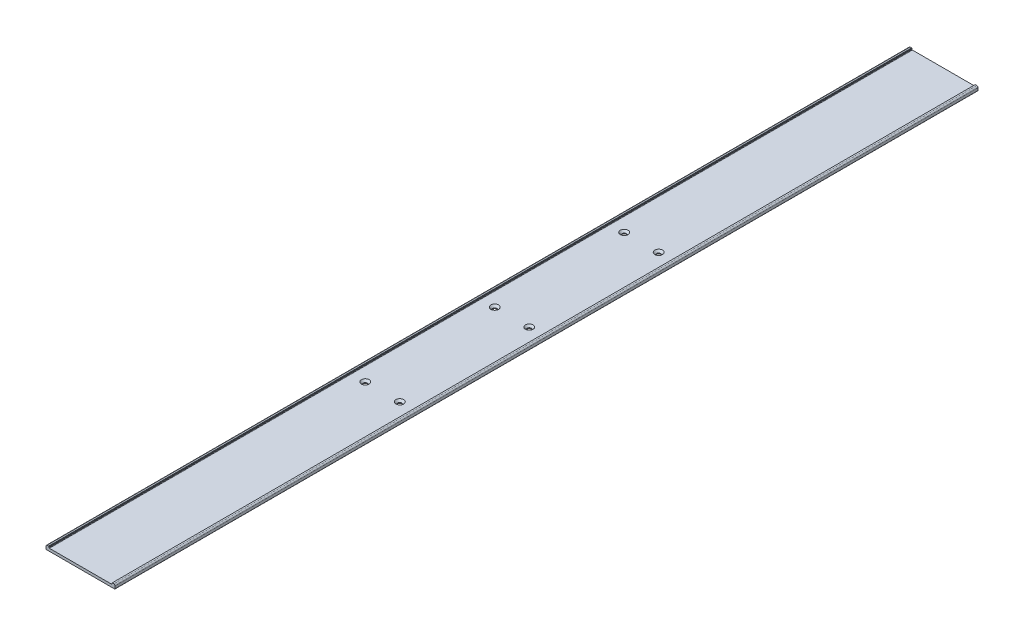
ISO-10303-21;
HEADER;
FILE_DESCRIPTION(('STEP AP214'),'2;1');
FILE_NAME('part.step','',(''),(''),'','','');
FILE_SCHEMA(('AUTOMOTIVE_DESIGN { 1 0 10303 214 1 1 1 1 }'));
ENDSEC;
DATA;
#1=APPLICATION_CONTEXT('core data for automotive mechanical design processes');
#2=APPLICATION_PROTOCOL_DEFINITION('international standard','automotive_design',2000,#1);
#3=PRODUCT_CONTEXT('',#1,'mechanical');
#4=PRODUCT('Part','Part','',(#3));
#5=PRODUCT_RELATED_PRODUCT_CATEGORY('part','',(#4));
#6=PRODUCT_DEFINITION_FORMATION('','',#4);
#7=PRODUCT_DEFINITION_CONTEXT('part definition',#1,'design');
#8=PRODUCT_DEFINITION('design','',#6,#7);
#9=PRODUCT_DEFINITION_SHAPE('','',#8);
#10=(LENGTH_UNIT() NAMED_UNIT(*) SI_UNIT(.MILLI.,.METRE.));
#11=(NAMED_UNIT(*) PLANE_ANGLE_UNIT() SI_UNIT($,.RADIAN.));
#12=(NAMED_UNIT(*) SI_UNIT($,.STERADIAN.) SOLID_ANGLE_UNIT());
#13=UNCERTAINTY_MEASURE_WITH_UNIT(LENGTH_MEASURE(1.E-05),#10,'distance_accuracy_value','');
#14=(GEOMETRIC_REPRESENTATION_CONTEXT(3) GLOBAL_UNCERTAINTY_ASSIGNED_CONTEXT((#13)) GLOBAL_UNIT_ASSIGNED_CONTEXT((#10,
#11,#12)) REPRESENTATION_CONTEXT('',''));
#15=CARTESIAN_POINT('',(0.,0.,0.));
#16=DIRECTION('',(0.,0.,1.));
#17=DIRECTION('',(1.,0.,0.));
#18=AXIS2_PLACEMENT_3D('',#15,#16,#17);
#19=CARTESIAN_POINT('',(79.5,0.5,-500.));
#20=DIRECTION('',(0.,0.,1.));
#21=DIRECTION('',(1.,0.,0.));
#22=AXIS2_PLACEMENT_3D('',#19,#20,#21);
#23=CYLINDRICAL_SURFACE('',#22,0.5);
#24=CARTESIAN_POINT('',(79.5,0.5,500.));
#25=DIRECTION('',(0.,0.,1.));
#26=DIRECTION('',(1.,0.,0.));
#27=AXIS2_PLACEMENT_3D('',#24,#25,#26);
#28=CIRCLE('',#27,0.5);
#29=CARTESIAN_POINT('',(79.5,0.,500.));
#30=VERTEX_POINT('',#29);
#31=CARTESIAN_POINT('',(80.,0.5,500.));
#32=VERTEX_POINT('',#31);
#33=EDGE_CURVE('E187',#30,#32,#28,.T.);
#34=ORIENTED_EDGE('',*,*,#33,.F.);
#35=DIRECTION('',(0.,0.,1.));
#36=VECTOR('',#35,1.);
#37=CARTESIAN_POINT('',(79.5,0.,-500.));
#38=LINE('',#37,#36);
#39=CARTESIAN_POINT('',(79.5,0.,-500.));
#40=VERTEX_POINT('',#39);
#41=EDGE_CURVE('E11',#40,#30,#38,.T.);
#42=ORIENTED_EDGE('',*,*,#41,.F.);
#43=CARTESIAN_POINT('',(79.5,0.5,-500.));
#44=DIRECTION('',(0.,0.,1.));
#45=DIRECTION('',(1.,0.,0.));
#46=AXIS2_PLACEMENT_3D('',#43,#44,#45);
#47=CIRCLE('',#46,0.5);
#48=CARTESIAN_POINT('',(80.,0.5,-500.));
#49=VERTEX_POINT('',#48);
#50=EDGE_CURVE('E232',#40,#49,#47,.T.);
#51=ORIENTED_EDGE('',*,*,#50,.T.);
#52=DIRECTION('',(0.,0.,1.));
#53=VECTOR('',#52,1.);
#54=CARTESIAN_POINT('',(80.,0.5,-500.));
#55=LINE('',#54,#53);
#56=EDGE_CURVE('E121',#49,#32,#55,.T.);
#57=ORIENTED_EDGE('',*,*,#56,.T.);
#58=EDGE_LOOP('',(#34,#42,#51,#57));
#59=FACE_BOUND('',#58,.T.);
#60=ADVANCED_FACE('F41',(#59),#23,.T.);
#61=CARTESIAN_POINT('',(0.500000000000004,0.,-500.));
#62=DIRECTION('',(0.,-1.,0.));
#63=DIRECTION('',(0.,0.,-1.));
#64=AXIS2_PLACEMENT_3D('',#61,#62,#63);
#65=PLANE('',#64);
#66=CARTESIAN_POINT('',(60.,0.,-150.));
#67=DIRECTION('',(0.,-1.,0.));
#68=DIRECTION('',(0.,0.,-1.));
#69=AXIS2_PLACEMENT_3D('',#66,#67,#68);
#70=CIRCLE('',#69,2.24999999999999);
#71=CARTESIAN_POINT('',(60.,0.,-152.25));
#72=VERTEX_POINT('',#71);
#73=EDGE_CURVE('E44',#72,#72,#70,.T.);
#74=ORIENTED_EDGE('',*,*,#73,.F.);
#75=EDGE_LOOP('',(#74));
#76=FACE_BOUND('',#75,.T.);
#77=CARTESIAN_POINT('',(60.,0.,150.));
#78=DIRECTION('',(0.,-1.,0.));
#79=DIRECTION('',(0.,0.,-1.));
#80=AXIS2_PLACEMENT_3D('',#77,#78,#79);
#81=CIRCLE('',#80,2.24999999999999);
#82=CARTESIAN_POINT('',(60.,0.,147.75));
#83=VERTEX_POINT('',#82);
#84=EDGE_CURVE('E276',#83,#83,#81,.T.);
#85=ORIENTED_EDGE('',*,*,#84,.F.);
#86=EDGE_LOOP('',(#85));
#87=FACE_BOUND('',#86,.T.);
#88=CARTESIAN_POINT('',(60.,0.,0.));
#89=DIRECTION('',(0.,-1.,0.));
#90=DIRECTION('',(0.,0.,-1.));
#91=AXIS2_PLACEMENT_3D('',#88,#89,#90);
#92=CIRCLE('',#91,2.24999999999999);
#93=CARTESIAN_POINT('',(60.,0.,-2.24999999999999));
#94=VERTEX_POINT('',#93);
#95=EDGE_CURVE('E272',#94,#94,#92,.T.);
#96=ORIENTED_EDGE('',*,*,#95,.F.);
#97=EDGE_LOOP('',(#96));
#98=FACE_BOUND('',#97,.T.);
#99=CARTESIAN_POINT('',(20.,0.,-150.));
#100=DIRECTION('',(0.,-1.,0.));
#101=DIRECTION('',(0.,0.,-1.));
#102=AXIS2_PLACEMENT_3D('',#99,#100,#101);
#103=CIRCLE('',#102,2.24999999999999);
#104=CARTESIAN_POINT('',(20.,0.,-152.25));
#105=VERTEX_POINT('',#104);
#106=EDGE_CURVE('E267',#105,#105,#103,.T.);
#107=ORIENTED_EDGE('',*,*,#106,.F.);
#108=EDGE_LOOP('',(#107));
#109=FACE_BOUND('',#108,.T.);
#110=CARTESIAN_POINT('',(20.,0.,150.));
#111=DIRECTION('',(0.,-1.,0.));
#112=DIRECTION('',(0.,0.,-1.));
#113=AXIS2_PLACEMENT_3D('',#110,#111,#112);
#114=CIRCLE('',#113,2.24999999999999);
#115=CARTESIAN_POINT('',(20.,0.,147.75));
#116=VERTEX_POINT('',#115);
#117=EDGE_CURVE('E262',#116,#116,#114,.T.);
#118=ORIENTED_EDGE('',*,*,#117,.F.);
#119=EDGE_LOOP('',(#118));
#120=FACE_BOUND('',#119,.T.);
#121=CARTESIAN_POINT('',(20.,0.,0.));
#122=DIRECTION('',(0.,-1.,0.));
#123=DIRECTION('',(0.,0.,-1.));
#124=AXIS2_PLACEMENT_3D('',#121,#122,#123);
#125=CIRCLE('',#124,2.24999999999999);
#126=CARTESIAN_POINT('',(20.,0.,-2.24999999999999));
#127=VERTEX_POINT('',#126);
#128=EDGE_CURVE('E191',#127,#127,#125,.T.);
#129=ORIENTED_EDGE('',*,*,#128,.F.);
#130=EDGE_LOOP('',(#129));
#131=FACE_BOUND('',#130,.T.);
#132=DIRECTION('',(1.,0.,0.));
#133=VECTOR('',#132,1.);
#134=CARTESIAN_POINT('',(0.500000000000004,0.,500.));
#135=LINE('',#134,#133);
#136=CARTESIAN_POINT('',(0.500000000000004,0.,500.));
#137=VERTEX_POINT('',#136);
#138=EDGE_CURVE('E230',#137,#30,#135,.T.);
#139=ORIENTED_EDGE('',*,*,#138,.F.);
#140=DIRECTION('',(0.,0.,1.));
#141=VECTOR('',#140,1.);
#142=CARTESIAN_POINT('',(0.500000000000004,0.,-500.));
#143=LINE('',#142,#141);
#144=CARTESIAN_POINT('',(0.500000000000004,0.,-500.));
#145=VERTEX_POINT('',#144);
#146=EDGE_CURVE('E50',#145,#137,#143,.T.);
#147=ORIENTED_EDGE('',*,*,#146,.F.);
#148=DIRECTION('',(1.,0.,0.));
#149=VECTOR('',#148,1.);
#150=CARTESIAN_POINT('',(0.500000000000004,0.,-500.));
#151=LINE('',#150,#149);
#152=EDGE_CURVE('E177',#145,#40,#151,.T.);
#153=ORIENTED_EDGE('',*,*,#152,.T.);
#154=ORIENTED_EDGE('',*,*,#41,.T.);
#155=EDGE_LOOP('',(#139,#147,#153,#154));
#156=FACE_BOUND('',#155,.T.);
#157=ADVANCED_FACE('F381',(#76,#87,#98,#109,#120,#131,#156),#65,.T.);
#158=CARTESIAN_POINT('',(0.5,0.5,-500.));
#159=DIRECTION('',(0.,0.,1.));
#160=DIRECTION('',(1.,0.,0.));
#161=AXIS2_PLACEMENT_3D('',#158,#159,#160);
#162=CYLINDRICAL_SURFACE('',#161,0.5);
#163=CARTESIAN_POINT('',(0.5,0.5,500.));
#164=DIRECTION('',(0.,0.,1.));
#165=DIRECTION('',(1.,0.,0.));
#166=AXIS2_PLACEMENT_3D('',#163,#164,#165);
#167=CIRCLE('',#166,0.5);
#168=CARTESIAN_POINT('',(0.,0.500000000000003,500.));
#169=VERTEX_POINT('',#168);
#170=EDGE_CURVE('E164',#169,#137,#167,.T.);
#171=ORIENTED_EDGE('',*,*,#170,.F.);
#172=DIRECTION('',(0.,0.,1.));
#173=VECTOR('',#172,1.);
#174=CARTESIAN_POINT('',(0.,0.500000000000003,-500.));
#175=LINE('',#174,#173);
#176=CARTESIAN_POINT('',(0.,0.500000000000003,-500.));
#177=VERTEX_POINT('',#176);
#178=EDGE_CURVE('E159',#177,#169,#175,.T.);
#179=ORIENTED_EDGE('',*,*,#178,.F.);
#180=CARTESIAN_POINT('',(0.5,0.5,-500.));
#181=DIRECTION('',(0.,0.,1.));
#182=DIRECTION('',(1.,0.,0.));
#183=AXIS2_PLACEMENT_3D('',#180,#181,#182);
#184=CIRCLE('',#183,0.5);
#185=EDGE_CURVE('E162',#177,#145,#184,.T.);
#186=ORIENTED_EDGE('',*,*,#185,.T.);
#187=ORIENTED_EDGE('',*,*,#146,.T.);
#188=EDGE_LOOP('',(#171,#179,#186,#187));
#189=FACE_BOUND('',#188,.T.);
#190=ADVANCED_FACE('F161',(#189),#162,.T.);
#191=CARTESIAN_POINT('',(0.,0.500000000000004,-500.));
#192=DIRECTION('',(-1.,0.,0.));
#193=DIRECTION('',(0.,0.,1.));
#194=AXIS2_PLACEMENT_3D('',#191,#192,#193);
#195=PLANE('',#194);
#196=DIRECTION('',(0.,-1.,0.));
#197=VECTOR('',#196,1.);
#198=CARTESIAN_POINT('',(0.,0.500000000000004,500.));
#199=LINE('',#198,#197);
#200=CARTESIAN_POINT('',(0.,3.3,500.));
#201=VERTEX_POINT('',#200);
#202=EDGE_CURVE('E227',#201,#169,#199,.T.);
#203=ORIENTED_EDGE('',*,*,#202,.F.);
#204=DIRECTION('',(0.,0.,1.));
#205=VECTOR('',#204,1.);
#206=CARTESIAN_POINT('',(0.,3.3,-500.));
#207=LINE('',#206,#205);
#208=CARTESIAN_POINT('',(0.,3.3,-500.));
#209=VERTEX_POINT('',#208);
#210=EDGE_CURVE('E169',#209,#201,#207,.T.);
#211=ORIENTED_EDGE('',*,*,#210,.F.);
#212=DIRECTION('',(0.,-1.,0.));
#213=VECTOR('',#212,1.);
#214=CARTESIAN_POINT('',(0.,0.500000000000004,-500.));
#215=LINE('',#214,#213);
#216=EDGE_CURVE('E175',#209,#177,#215,.T.);
#217=ORIENTED_EDGE('',*,*,#216,.T.);
#218=ORIENTED_EDGE('',*,*,#178,.T.);
#219=EDGE_LOOP('',(#203,#211,#217,#218));
#220=FACE_BOUND('',#219,.T.);
#221=ADVANCED_FACE('F179',(#220),#195,.T.);
#222=CARTESIAN_POINT('',(1.5,3.3,-500.));
#223=DIRECTION('',(0.,0.,1.));
#224=DIRECTION('',(1.,0.,0.));
#225=AXIS2_PLACEMENT_3D('',#222,#223,#224);
#226=CYLINDRICAL_SURFACE('',#225,1.5);
#227=CARTESIAN_POINT('',(1.5,3.3,500.));
#228=DIRECTION('',(0.,0.,1.));
#229=DIRECTION('',(-1.,0.,0.));
#230=AXIS2_PLACEMENT_3D('',#227,#228,#229);
#231=CIRCLE('',#230,1.5);
#232=CARTESIAN_POINT('',(1.5,4.8,500.));
#233=VERTEX_POINT('',#232);
#234=EDGE_CURVE('E224',#233,#201,#231,.T.);
#235=ORIENTED_EDGE('',*,*,#234,.F.);
#236=DIRECTION('',(0.,0.,1.));
#237=VECTOR('',#236,1.);
#238=CARTESIAN_POINT('',(1.5,4.8,-500.));
#239=LINE('',#238,#237);
#240=CARTESIAN_POINT('',(1.5,4.8,-500.));
#241=VERTEX_POINT('',#240);
#242=EDGE_CURVE('E236',#241,#233,#239,.T.);
#243=ORIENTED_EDGE('',*,*,#242,.F.);
#244=CARTESIAN_POINT('',(1.5,3.3,-500.));
#245=DIRECTION('',(0.,0.,1.));
#246=DIRECTION('',(-1.,0.,0.));
#247=AXIS2_PLACEMENT_3D('',#244,#245,#246);
#248=CIRCLE('',#247,1.5);
#249=EDGE_CURVE('E180',#241,#209,#248,.T.);
#250=ORIENTED_EDGE('',*,*,#249,.T.);
#251=ORIENTED_EDGE('',*,*,#210,.T.);
#252=EDGE_LOOP('',(#235,#243,#250,#251));
#253=FACE_BOUND('',#252,.T.);
#254=ADVANCED_FACE('F399',(#253),#226,.T.);
#255=CARTESIAN_POINT('',(1.5,4.8,-500.));
#256=DIRECTION('',(0.,1.,0.));
#257=DIRECTION('',(-1.,0.,0.));
#258=AXIS2_PLACEMENT_3D('',#255,#256,#257);
#259=PLANE('',#258);
#260=DIRECTION('',(-1.,0.,0.));
#261=VECTOR('',#260,1.);
#262=CARTESIAN_POINT('',(1.5,4.8,500.));
#263=LINE('',#262,#261);
#264=CARTESIAN_POINT('',(3.,4.8,500.));
#265=VERTEX_POINT('',#264);
#266=EDGE_CURVE('E221',#265,#233,#263,.T.);
#267=ORIENTED_EDGE('',*,*,#266,.F.);
#268=DIRECTION('',(0.,0.,1.));
#269=VECTOR('',#268,1.);
#270=CARTESIAN_POINT('',(3.,4.8,-500.));
#271=LINE('',#270,#269);
#272=CARTESIAN_POINT('',(3.,4.8,-500.));
#273=VERTEX_POINT('',#272);
#274=EDGE_CURVE('E238',#273,#265,#271,.T.);
#275=ORIENTED_EDGE('',*,*,#274,.F.);
#276=DIRECTION('',(-1.,0.,0.));
#277=VECTOR('',#276,1.);
#278=CARTESIAN_POINT('',(1.5,4.8,-500.));
#279=LINE('',#278,#277);
#280=EDGE_CURVE('E182',#273,#241,#279,.T.);
#281=ORIENTED_EDGE('',*,*,#280,.T.);
#282=ORIENTED_EDGE('',*,*,#242,.T.);
#283=EDGE_LOOP('',(#267,#275,#281,#282));
#284=FACE_BOUND('',#283,.T.);
#285=ADVANCED_FACE('F340',(#284),#259,.T.);
#286=CARTESIAN_POINT('',(3.,4.8,-500.));
#287=DIRECTION('',(0.707106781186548,0.707106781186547,0.));
#288=DIRECTION('',(-0.707106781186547,0.707106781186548,0.));
#289=AXIS2_PLACEMENT_3D('',#286,#287,#288);
#290=PLANE('',#289);
#291=DIRECTION('',(-0.707106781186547,0.707106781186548,0.));
#292=VECTOR('',#291,1.);
#293=CARTESIAN_POINT('',(3.,4.8,500.));
#294=LINE('',#293,#292);
#295=CARTESIAN_POINT('',(3.5,4.3,500.));
#296=VERTEX_POINT('',#295);
#297=EDGE_CURVE('E218',#296,#265,#294,.T.);
#298=ORIENTED_EDGE('',*,*,#297,.F.);
#299=DIRECTION('',(0.,0.,1.));
#300=VECTOR('',#299,1.);
#301=CARTESIAN_POINT('',(3.5,4.3,-500.));
#302=LINE('',#301,#300);
#303=CARTESIAN_POINT('',(3.5,4.3,-500.));
#304=VERTEX_POINT('',#303);
#305=EDGE_CURVE('E240',#304,#296,#302,.T.);
#306=ORIENTED_EDGE('',*,*,#305,.F.);
#307=DIRECTION('',(-0.707106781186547,0.707106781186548,0.));
#308=VECTOR('',#307,1.);
#309=CARTESIAN_POINT('',(3.,4.8,-500.));
#310=LINE('',#309,#308);
#311=EDGE_CURVE('E334',#304,#273,#310,.T.);
#312=ORIENTED_EDGE('',*,*,#311,.T.);
#313=ORIENTED_EDGE('',*,*,#274,.T.);
#314=EDGE_LOOP('',(#298,#306,#312,#313));
#315=FACE_BOUND('',#314,.T.);
#316=ADVANCED_FACE('F346',(#315),#290,.T.);
#317=CARTESIAN_POINT('',(3.5,4.3,-500.));
#318=DIRECTION('',(1.,0.,0.));
#319=DIRECTION('',(0.,1.,0.));
#320=AXIS2_PLACEMENT_3D('',#317,#318,#319);
#321=PLANE('',#320);
#322=DIRECTION('',(0.,1.,0.));
#323=VECTOR('',#322,1.);
#324=CARTESIAN_POINT('',(3.5,4.3,500.));
#325=LINE('',#324,#323);
#326=CARTESIAN_POINT('',(3.5,3.6,500.));
#327=VERTEX_POINT('',#326);
#328=EDGE_CURVE('E215',#327,#296,#325,.T.);
#329=ORIENTED_EDGE('',*,*,#328,.F.);
#330=DIRECTION('',(0.,0.,1.));
#331=VECTOR('',#330,1.);
#332=CARTESIAN_POINT('',(3.5,3.6,-500.));
#333=LINE('',#332,#331);
#334=CARTESIAN_POINT('',(3.5,3.6,-500.));
#335=VERTEX_POINT('',#334);
#336=EDGE_CURVE('E242',#335,#327,#333,.T.);
#337=ORIENTED_EDGE('',*,*,#336,.F.);
#338=DIRECTION('',(0.,1.,0.));
#339=VECTOR('',#338,1.);
#340=CARTESIAN_POINT('',(3.5,4.3,-500.));
#341=LINE('',#340,#339);
#342=EDGE_CURVE('E331',#335,#304,#341,.T.);
#343=ORIENTED_EDGE('',*,*,#342,.T.);
#344=ORIENTED_EDGE('',*,*,#305,.T.);
#345=EDGE_LOOP('',(#329,#337,#343,#344));
#346=FACE_BOUND('',#345,.T.);
#347=ADVANCED_FACE('F349',(#346),#321,.T.);
#348=CARTESIAN_POINT('',(4.,3.6,-500.));
#349=DIRECTION('',(0.,0.,1.));
#350=DIRECTION('',(1.,0.,0.));
#351=AXIS2_PLACEMENT_3D('',#348,#349,#350);
#352=CYLINDRICAL_SURFACE('',#351,0.5);
#353=CARTESIAN_POINT('',(4.,3.6,500.));
#354=DIRECTION('',(0.,0.,-1.));
#355=DIRECTION('',(1.,0.,0.));
#356=AXIS2_PLACEMENT_3D('',#353,#354,#355);
#357=CIRCLE('',#356,0.5);
#358=CARTESIAN_POINT('',(4.,3.1,500.));
#359=VERTEX_POINT('',#358);
#360=EDGE_CURVE('E212',#359,#327,#357,.T.);
#361=ORIENTED_EDGE('',*,*,#360,.F.);
#362=DIRECTION('',(0.,0.,1.));
#363=VECTOR('',#362,1.);
#364=CARTESIAN_POINT('',(4.,3.1,-500.));
#365=LINE('',#364,#363);
#366=CARTESIAN_POINT('',(4.,3.1,-500.));
#367=VERTEX_POINT('',#366);
#368=EDGE_CURVE('E244',#367,#359,#365,.T.);
#369=ORIENTED_EDGE('',*,*,#368,.F.);
#370=CARTESIAN_POINT('',(4.,3.6,-500.));
#371=DIRECTION('',(0.,0.,-1.));
#372=DIRECTION('',(1.,0.,0.));
#373=AXIS2_PLACEMENT_3D('',#370,#371,#372);
#374=CIRCLE('',#373,0.5);
#375=EDGE_CURVE('E328',#367,#335,#374,.T.);
#376=ORIENTED_EDGE('',*,*,#375,.T.);
#377=ORIENTED_EDGE('',*,*,#336,.T.);
#378=EDGE_LOOP('',(#361,#369,#376,#377));
#379=FACE_BOUND('',#378,.T.);
#380=ADVANCED_FACE('F354',(#379),#352,.F.);
#381=CARTESIAN_POINT('',(4.,3.1,-500.));
#382=DIRECTION('',(0.,1.,0.));
#383=DIRECTION('',(-1.,0.,0.));
#384=AXIS2_PLACEMENT_3D('',#381,#382,#383);
#385=PLANE('',#384);
#386=CARTESIAN_POINT('',(60.,3.1,-150.));
#387=DIRECTION('',(0.,1.,0.));
#388=DIRECTION('',(0.,0.,1.));
#389=AXIS2_PLACEMENT_3D('',#386,#387,#388);
#390=CIRCLE('',#389,4.48);
#391=CARTESIAN_POINT('',(60.,3.1,-145.52));
#392=VERTEX_POINT('',#391);
#393=EDGE_CURVE('E483',#392,#392,#390,.T.);
#394=ORIENTED_EDGE('',*,*,#393,.F.);
#395=EDGE_LOOP('',(#394));
#396=FACE_BOUND('',#395,.T.);
#397=CARTESIAN_POINT('',(60.,3.1,150.));
#398=DIRECTION('',(0.,1.,0.));
#399=DIRECTION('',(0.,0.,1.));
#400=AXIS2_PLACEMENT_3D('',#397,#398,#399);
#401=CIRCLE('',#400,4.48);
#402=CARTESIAN_POINT('',(60.,3.1,154.48));
#403=VERTEX_POINT('',#402);
#404=EDGE_CURVE('E285',#403,#403,#401,.T.);
#405=ORIENTED_EDGE('',*,*,#404,.F.);
#406=EDGE_LOOP('',(#405));
#407=FACE_BOUND('',#406,.T.);
#408=CARTESIAN_POINT('',(60.,3.1,0.));
#409=DIRECTION('',(0.,1.,0.));
#410=DIRECTION('',(0.,0.,1.));
#411=AXIS2_PLACEMENT_3D('',#408,#409,#410);
#412=CIRCLE('',#411,4.48);
#413=CARTESIAN_POINT('',(60.,3.1,4.48));
#414=VERTEX_POINT('',#413);
#415=EDGE_CURVE('E278',#414,#414,#412,.T.);
#416=ORIENTED_EDGE('',*,*,#415,.F.);
#417=EDGE_LOOP('',(#416));
#418=FACE_BOUND('',#417,.T.);
#419=CARTESIAN_POINT('',(20.,3.1,-150.));
#420=DIRECTION('',(0.,1.,0.));
#421=DIRECTION('',(0.,0.,1.));
#422=AXIS2_PLACEMENT_3D('',#419,#420,#421);
#423=CIRCLE('',#422,4.48);
#424=CARTESIAN_POINT('',(20.,3.1,-145.52));
#425=VERTEX_POINT('',#424);
#426=EDGE_CURVE('E274',#425,#425,#423,.T.);
#427=ORIENTED_EDGE('',*,*,#426,.F.);
#428=EDGE_LOOP('',(#427));
#429=FACE_BOUND('',#428,.T.);
#430=CARTESIAN_POINT('',(20.,3.1,150.));
#431=DIRECTION('',(0.,1.,0.));
#432=DIRECTION('',(0.,0.,1.));
#433=AXIS2_PLACEMENT_3D('',#430,#431,#432);
#434=CIRCLE('',#433,4.48);
#435=CARTESIAN_POINT('',(20.,3.1,154.48));
#436=VERTEX_POINT('',#435);
#437=EDGE_CURVE('E270',#436,#436,#434,.T.);
#438=ORIENTED_EDGE('',*,*,#437,.F.);
#439=EDGE_LOOP('',(#438));
#440=FACE_BOUND('',#439,.T.);
#441=CARTESIAN_POINT('',(20.,3.1,0.));
#442=DIRECTION('',(0.,1.,0.));
#443=DIRECTION('',(0.,0.,1.));
#444=AXIS2_PLACEMENT_3D('',#441,#442,#443);
#445=CIRCLE('',#444,4.48);
#446=CARTESIAN_POINT('',(20.,3.1,4.48));
#447=VERTEX_POINT('',#446);
#448=EDGE_CURVE('E265',#447,#447,#445,.T.);
#449=ORIENTED_EDGE('',*,*,#448,.F.);
#450=EDGE_LOOP('',(#449));
#451=FACE_BOUND('',#450,.T.);
#452=DIRECTION('',(-1.,0.,0.));
#453=VECTOR('',#452,1.);
#454=CARTESIAN_POINT('',(4.,3.1,500.));
#455=LINE('',#454,#453);
#456=CARTESIAN_POINT('',(76.,3.1,500.));
#457=VERTEX_POINT('',#456);
#458=EDGE_CURVE('E209',#457,#359,#455,.T.);
#459=ORIENTED_EDGE('',*,*,#458,.F.);
#460=DIRECTION('',(0.,0.,1.));
#461=VECTOR('',#460,1.);
#462=CARTESIAN_POINT('',(76.,3.1,-500.));
#463=LINE('',#462,#461);
#464=CARTESIAN_POINT('',(76.,3.1,-500.));
#465=VERTEX_POINT('',#464);
#466=EDGE_CURVE('E246',#465,#457,#463,.T.);
#467=ORIENTED_EDGE('',*,*,#466,.F.);
#468=DIRECTION('',(-1.,0.,0.));
#469=VECTOR('',#468,1.);
#470=CARTESIAN_POINT('',(4.,3.1,-500.));
#471=LINE('',#470,#469);
#472=EDGE_CURVE('E325',#465,#367,#471,.T.);
#473=ORIENTED_EDGE('',*,*,#472,.T.);
#474=ORIENTED_EDGE('',*,*,#368,.T.);
#475=EDGE_LOOP('',(#459,#467,#473,#474));
#476=FACE_BOUND('',#475,.T.);
#477=ADVANCED_FACE('F357',(#396,#407,#418,#429,#440,#451,#476),#385,.T.);
#478=CARTESIAN_POINT('',(76.,3.6,-500.));
#479=DIRECTION('',(0.,0.,1.));
#480=DIRECTION('',(1.,0.,0.));
#481=AXIS2_PLACEMENT_3D('',#478,#479,#480);
#482=CYLINDRICAL_SURFACE('',#481,0.5);
#483=CARTESIAN_POINT('',(76.,3.6,500.));
#484=DIRECTION('',(0.,0.,-1.));
#485=DIRECTION('',(-1.,0.,0.));
#486=AXIS2_PLACEMENT_3D('',#483,#484,#485);
#487=CIRCLE('',#486,0.5);
#488=CARTESIAN_POINT('',(76.5,3.6,500.));
#489=VERTEX_POINT('',#488);
#490=EDGE_CURVE('E206',#489,#457,#487,.T.);
#491=ORIENTED_EDGE('',*,*,#490,.F.);
#492=DIRECTION('',(0.,0.,1.));
#493=VECTOR('',#492,1.);
#494=CARTESIAN_POINT('',(76.5,3.6,-500.));
#495=LINE('',#494,#493);
#496=CARTESIAN_POINT('',(76.5,3.6,-500.));
#497=VERTEX_POINT('',#496);
#498=EDGE_CURVE('E248',#497,#489,#495,.T.);
#499=ORIENTED_EDGE('',*,*,#498,.F.);
#500=CARTESIAN_POINT('',(76.,3.6,-500.));
#501=DIRECTION('',(0.,0.,-1.));
#502=DIRECTION('',(-1.,0.,0.));
#503=AXIS2_PLACEMENT_3D('',#500,#501,#502);
#504=CIRCLE('',#503,0.5);
#505=EDGE_CURVE('E322',#497,#465,#504,.T.);
#506=ORIENTED_EDGE('',*,*,#505,.T.);
#507=ORIENTED_EDGE('',*,*,#466,.T.);
#508=EDGE_LOOP('',(#491,#499,#506,#507));
#509=FACE_BOUND('',#508,.T.);
#510=ADVANCED_FACE('F362',(#509),#482,.F.);
#511=CARTESIAN_POINT('',(76.5,4.55,-500.));
#512=DIRECTION('',(-1.,0.,0.));
#513=DIRECTION('',(0.,0.,1.));
#514=AXIS2_PLACEMENT_3D('',#511,#512,#513);
#515=PLANE('',#514);
#516=DIRECTION('',(0.,-1.,0.));
#517=VECTOR('',#516,1.);
#518=CARTESIAN_POINT('',(76.5,4.55,500.));
#519=LINE('',#518,#517);
#520=CARTESIAN_POINT('',(76.5,4.55,500.));
#521=VERTEX_POINT('',#520);
#522=EDGE_CURVE('E203',#521,#489,#519,.T.);
#523=ORIENTED_EDGE('',*,*,#522,.F.);
#524=DIRECTION('',(0.,0.,1.));
#525=VECTOR('',#524,1.);
#526=CARTESIAN_POINT('',(76.5,4.55,-500.));
#527=LINE('',#526,#525);
#528=CARTESIAN_POINT('',(76.5,4.55,-500.));
#529=VERTEX_POINT('',#528);
#530=EDGE_CURVE('E250',#529,#521,#527,.T.);
#531=ORIENTED_EDGE('',*,*,#530,.F.);
#532=DIRECTION('',(0.,-1.,0.));
#533=VECTOR('',#532,1.);
#534=CARTESIAN_POINT('',(76.5,4.55,-500.));
#535=LINE('',#534,#533);
#536=EDGE_CURVE('E319',#529,#497,#535,.T.);
#537=ORIENTED_EDGE('',*,*,#536,.T.);
#538=ORIENTED_EDGE('',*,*,#498,.T.);
#539=EDGE_LOOP('',(#523,#531,#537,#538));
#540=FACE_BOUND('',#539,.T.);
#541=ADVANCED_FACE('F365',(#540),#515,.T.);
#542=CARTESIAN_POINT('',(76.75,4.8,-500.));
#543=DIRECTION('',(-0.707106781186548,0.707106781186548,0.));
#544=DIRECTION('',(-0.707106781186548,-0.707106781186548,0.));
#545=AXIS2_PLACEMENT_3D('',#542,#543,#544);
#546=PLANE('',#545);
#547=DIRECTION('',(-0.707106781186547,-0.707106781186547,0.));
#548=VECTOR('',#547,1.);
#549=CARTESIAN_POINT('',(76.75,4.8,500.));
#550=LINE('',#549,#548);
#551=CARTESIAN_POINT('',(76.75,4.8,500.));
#552=VERTEX_POINT('',#551);
#553=EDGE_CURVE('E200',#552,#521,#550,.T.);
#554=ORIENTED_EDGE('',*,*,#553,.F.);
#555=DIRECTION('',(0.,0.,1.));
#556=VECTOR('',#555,1.);
#557=CARTESIAN_POINT('',(76.75,4.8,-500.));
#558=LINE('',#557,#556);
#559=CARTESIAN_POINT('',(76.75,4.8,-500.));
#560=VERTEX_POINT('',#559);
#561=EDGE_CURVE('E252',#560,#552,#558,.T.);
#562=ORIENTED_EDGE('',*,*,#561,.F.);
#563=DIRECTION('',(-0.707106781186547,-0.707106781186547,0.));
#564=VECTOR('',#563,1.);
#565=CARTESIAN_POINT('',(76.75,4.8,-500.));
#566=LINE('',#565,#564);
#567=EDGE_CURVE('E316',#560,#529,#566,.T.);
#568=ORIENTED_EDGE('',*,*,#567,.T.);
#569=ORIENTED_EDGE('',*,*,#530,.T.);
#570=EDGE_LOOP('',(#554,#562,#568,#569));
#571=FACE_BOUND('',#570,.T.);
#572=ADVANCED_FACE('F370',(#571),#546,.T.);
#573=CARTESIAN_POINT('',(76.75,4.8,-500.));
#574=DIRECTION('',(0.,1.,0.));
#575=DIRECTION('',(0.,0.,1.));
#576=AXIS2_PLACEMENT_3D('',#573,#574,#575);
#577=PLANE('',#576);
#578=DIRECTION('',(-1.,0.,0.));
#579=VECTOR('',#578,1.);
#580=CARTESIAN_POINT('',(76.75,4.8,500.));
#581=LINE('',#580,#579);
#582=CARTESIAN_POINT('',(78.5,4.8,500.));
#583=VERTEX_POINT('',#582);
#584=EDGE_CURVE('E197',#583,#552,#581,.T.);
#585=ORIENTED_EDGE('',*,*,#584,.F.);
#586=DIRECTION('',(0.,0.,1.));
#587=VECTOR('',#586,1.);
#588=CARTESIAN_POINT('',(78.5,4.8,-500.));
#589=LINE('',#588,#587);
#590=CARTESIAN_POINT('',(78.5,4.8,-500.));
#591=VERTEX_POINT('',#590);
#592=EDGE_CURVE('E254',#591,#583,#589,.T.);
#593=ORIENTED_EDGE('',*,*,#592,.F.);
#594=DIRECTION('',(-1.,0.,0.));
#595=VECTOR('',#594,1.);
#596=CARTESIAN_POINT('',(76.75,4.8,-500.));
#597=LINE('',#596,#595);
#598=EDGE_CURVE('E313',#591,#560,#597,.T.);
#599=ORIENTED_EDGE('',*,*,#598,.T.);
#600=ORIENTED_EDGE('',*,*,#561,.T.);
#601=EDGE_LOOP('',(#585,#593,#599,#600));
#602=FACE_BOUND('',#601,.T.);
#603=ADVANCED_FACE('F373',(#602),#577,.T.);
#604=CARTESIAN_POINT('',(78.5,3.3,-500.));
#605=DIRECTION('',(0.,0.,1.));
#606=DIRECTION('',(1.,0.,0.));
#607=AXIS2_PLACEMENT_3D('',#604,#605,#606);
#608=CYLINDRICAL_SURFACE('',#607,1.5);
#609=CARTESIAN_POINT('',(78.5,3.3,500.));
#610=DIRECTION('',(0.,0.,1.));
#611=DIRECTION('',(-1.,0.,0.));
#612=AXIS2_PLACEMENT_3D('',#609,#610,#611);
#613=CIRCLE('',#612,1.5);
#614=CARTESIAN_POINT('',(80.,3.3,500.));
#615=VERTEX_POINT('',#614);
#616=EDGE_CURVE('E194',#615,#583,#613,.T.);
#617=ORIENTED_EDGE('',*,*,#616,.F.);
#618=DIRECTION('',(0.,0.,1.));
#619=VECTOR('',#618,1.);
#620=CARTESIAN_POINT('',(80.,3.3,-500.));
#621=LINE('',#620,#619);
#622=CARTESIAN_POINT('',(80.,3.3,-500.));
#623=VERTEX_POINT('',#622);
#624=EDGE_CURVE('E256',#623,#615,#621,.T.);
#625=ORIENTED_EDGE('',*,*,#624,.F.);
#626=CARTESIAN_POINT('',(78.5,3.3,-500.));
#627=DIRECTION('',(0.,0.,1.));
#628=DIRECTION('',(-1.,0.,0.));
#629=AXIS2_PLACEMENT_3D('',#626,#627,#628);
#630=CIRCLE('',#629,1.5);
#631=EDGE_CURVE('E310',#623,#591,#630,.T.);
#632=ORIENTED_EDGE('',*,*,#631,.T.);
#633=ORIENTED_EDGE('',*,*,#592,.T.);
#634=EDGE_LOOP('',(#617,#625,#632,#633));
#635=FACE_BOUND('',#634,.T.);
#636=ADVANCED_FACE('F377',(#635),#608,.T.);
#637=CARTESIAN_POINT('',(80.,0.5,-500.));
#638=DIRECTION('',(1.,0.,0.));
#639=DIRECTION('',(0.,0.,-1.));
#640=AXIS2_PLACEMENT_3D('',#637,#638,#639);
#641=PLANE('',#640);
#642=DIRECTION('',(0.,1.,0.));
#643=VECTOR('',#642,1.);
#644=CARTESIAN_POINT('',(80.,0.5,500.));
#645=LINE('',#644,#643);
#646=EDGE_CURVE('E190',#32,#615,#645,.T.);
#647=ORIENTED_EDGE('',*,*,#646,.F.);
#648=ORIENTED_EDGE('',*,*,#56,.F.);
#649=DIRECTION('',(0.,1.,0.));
#650=VECTOR('',#649,1.);
#651=CARTESIAN_POINT('',(80.,0.5,-500.));
#652=LINE('',#651,#650);
#653=EDGE_CURVE('E308',#49,#623,#652,.T.);
#654=ORIENTED_EDGE('',*,*,#653,.T.);
#655=ORIENTED_EDGE('',*,*,#624,.T.);
#656=EDGE_LOOP('',(#647,#648,#654,#655));
#657=FACE_BOUND('',#656,.T.);
#658=ADVANCED_FACE('F378',(#657),#641,.T.);
#659=CARTESIAN_POINT('',(79.5,0.5,-500.));
#660=DIRECTION('',(0.,0.,1.));
#661=DIRECTION('',(1.,0.,0.));
#662=AXIS2_PLACEMENT_3D('',#659,#660,#661);
#663=PLANE('',#662);
#664=ORIENTED_EDGE('',*,*,#50,.F.);
#665=ORIENTED_EDGE('',*,*,#152,.F.);
#666=ORIENTED_EDGE('',*,*,#185,.F.);
#667=ORIENTED_EDGE('',*,*,#216,.F.);
#668=ORIENTED_EDGE('',*,*,#249,.F.);
#669=ORIENTED_EDGE('',*,*,#280,.F.);
#670=ORIENTED_EDGE('',*,*,#311,.F.);
#671=ORIENTED_EDGE('',*,*,#342,.F.);
#672=ORIENTED_EDGE('',*,*,#375,.F.);
#673=ORIENTED_EDGE('',*,*,#472,.F.);
#674=ORIENTED_EDGE('',*,*,#505,.F.);
#675=ORIENTED_EDGE('',*,*,#536,.F.);
#676=ORIENTED_EDGE('',*,*,#567,.F.);
#677=ORIENTED_EDGE('',*,*,#598,.F.);
#678=ORIENTED_EDGE('',*,*,#631,.F.);
#679=ORIENTED_EDGE('',*,*,#653,.F.);
#680=EDGE_LOOP('',(#664,#665,#666,#667,#668,#669,#670,#671,#672,#673,#674,#675,#676,#677,#678,#679));
#681=FACE_BOUND('',#680,.T.);
#682=ADVANCED_FACE('F173',(#681),#663,.F.);
#683=CARTESIAN_POINT('',(79.5,0.5,500.));
#684=DIRECTION('',(0.,0.,1.));
#685=DIRECTION('',(1.,0.,0.));
#686=AXIS2_PLACEMENT_3D('',#683,#684,#685);
#687=PLANE('',#686);
#688=ORIENTED_EDGE('',*,*,#33,.T.);
#689=ORIENTED_EDGE('',*,*,#646,.T.);
#690=ORIENTED_EDGE('',*,*,#616,.T.);
#691=ORIENTED_EDGE('',*,*,#584,.T.);
#692=ORIENTED_EDGE('',*,*,#553,.T.);
#693=ORIENTED_EDGE('',*,*,#522,.T.);
#694=ORIENTED_EDGE('',*,*,#490,.T.);
#695=ORIENTED_EDGE('',*,*,#458,.T.);
#696=ORIENTED_EDGE('',*,*,#360,.T.);
#697=ORIENTED_EDGE('',*,*,#328,.T.);
#698=ORIENTED_EDGE('',*,*,#297,.T.);
#699=ORIENTED_EDGE('',*,*,#266,.T.);
#700=ORIENTED_EDGE('',*,*,#234,.T.);
#701=ORIENTED_EDGE('',*,*,#202,.T.);
#702=ORIENTED_EDGE('',*,*,#170,.T.);
#703=ORIENTED_EDGE('',*,*,#138,.T.);
#704=EDGE_LOOP('',(#688,#689,#690,#691,#692,#693,#694,#695,#696,#697,#698,#699,#700,#701,#702,#703));
#705=FACE_BOUND('',#704,.T.);
#706=ADVANCED_FACE('F380',(#705),#687,.T.);
#707=CARTESIAN_POINT('',(20.,3.1,0.));
#708=DIRECTION('',(0.,1.,0.));
#709=DIRECTION('',(0.,0.,1.));
#710=AXIS2_PLACEMENT_3D('',#707,#708,#709);
#711=CYLINDRICAL_SURFACE('',#710,2.24999999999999);
#712=ORIENTED_EDGE('',*,*,#128,.T.);
#713=EDGE_LOOP('',(#712));
#714=FACE_BOUND('',#713,.T.);
#715=CARTESIAN_POINT('',(20.,0.869999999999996,0.));
#716=DIRECTION('',(0.,1.,0.));
#717=DIRECTION('',(0.,0.,1.));
#718=AXIS2_PLACEMENT_3D('',#715,#716,#717);
#719=CIRCLE('',#718,2.25);
#720=CARTESIAN_POINT('',(20.,0.869999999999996,2.25));
#721=VERTEX_POINT('',#720);
#722=EDGE_CURVE('E261',#721,#721,#719,.T.);
#723=ORIENTED_EDGE('',*,*,#722,.T.);
#724=EDGE_LOOP('',(#723));
#725=FACE_BOUND('',#724,.T.);
#726=ADVANCED_FACE('F429',(#714,#725),#711,.F.);
#727=CARTESIAN_POINT('',(20.,3.1,0.));
#728=DIRECTION('',(0.,1.,0.));
#729=DIRECTION('',(0.,0.,1.));
#730=AXIS2_PLACEMENT_3D('',#727,#728,#729);
#731=CONICAL_SURFACE('',#730,4.48,0.785398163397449);
#732=ORIENTED_EDGE('',*,*,#722,.F.);
#733=EDGE_LOOP('',(#732));
#734=FACE_BOUND('',#733,.T.);
#735=ORIENTED_EDGE('',*,*,#448,.T.);
#736=EDGE_LOOP('',(#735));
#737=FACE_BOUND('',#736,.T.);
#738=ADVANCED_FACE('F433',(#734,#737),#731,.F.);
#739=CARTESIAN_POINT('',(20.,3.1,150.));
#740=DIRECTION('',(0.,1.,0.));
#741=DIRECTION('',(0.,0.,1.));
#742=AXIS2_PLACEMENT_3D('',#739,#740,#741);
#743=CYLINDRICAL_SURFACE('',#742,2.24999999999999);
#744=ORIENTED_EDGE('',*,*,#117,.T.);
#745=EDGE_LOOP('',(#744));
#746=FACE_BOUND('',#745,.T.);
#747=CARTESIAN_POINT('',(20.,0.869999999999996,150.));
#748=DIRECTION('',(0.,1.,0.));
#749=DIRECTION('',(0.,0.,1.));
#750=AXIS2_PLACEMENT_3D('',#747,#748,#749);
#751=CIRCLE('',#750,2.25);
#752=CARTESIAN_POINT('',(20.,0.869999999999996,152.25));
#753=VERTEX_POINT('',#752);
#754=EDGE_CURVE('E266',#753,#753,#751,.T.);
#755=ORIENTED_EDGE('',*,*,#754,.T.);
#756=EDGE_LOOP('',(#755));
#757=FACE_BOUND('',#756,.T.);
#758=ADVANCED_FACE('F437',(#746,#757),#743,.F.);
#759=CARTESIAN_POINT('',(20.,3.1,150.));
#760=DIRECTION('',(0.,1.,0.));
#761=DIRECTION('',(0.,0.,1.));
#762=AXIS2_PLACEMENT_3D('',#759,#760,#761);
#763=CONICAL_SURFACE('',#762,4.48,0.785398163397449);
#764=ORIENTED_EDGE('',*,*,#754,.F.);
#765=EDGE_LOOP('',(#764));
#766=FACE_BOUND('',#765,.T.);
#767=ORIENTED_EDGE('',*,*,#437,.T.);
#768=EDGE_LOOP('',(#767));
#769=FACE_BOUND('',#768,.T.);
#770=ADVANCED_FACE('F441',(#766,#769),#763,.F.);
#771=CARTESIAN_POINT('',(20.,3.1,-150.));
#772=DIRECTION('',(0.,1.,0.));
#773=DIRECTION('',(0.,0.,1.));
#774=AXIS2_PLACEMENT_3D('',#771,#772,#773);
#775=CYLINDRICAL_SURFACE('',#774,2.24999999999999);
#776=ORIENTED_EDGE('',*,*,#106,.T.);
#777=EDGE_LOOP('',(#776));
#778=FACE_BOUND('',#777,.T.);
#779=CARTESIAN_POINT('',(20.,0.869999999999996,-150.));
#780=DIRECTION('',(0.,1.,0.));
#781=DIRECTION('',(0.,0.,1.));
#782=AXIS2_PLACEMENT_3D('',#779,#780,#781);
#783=CIRCLE('',#782,2.25);
#784=CARTESIAN_POINT('',(20.,0.869999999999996,-147.75));
#785=VERTEX_POINT('',#784);
#786=EDGE_CURVE('E271',#785,#785,#783,.T.);
#787=ORIENTED_EDGE('',*,*,#786,.T.);
#788=EDGE_LOOP('',(#787));
#789=FACE_BOUND('',#788,.T.);
#790=ADVANCED_FACE('F445',(#778,#789),#775,.F.);
#791=CARTESIAN_POINT('',(20.,3.1,-150.));
#792=DIRECTION('',(0.,1.,0.));
#793=DIRECTION('',(0.,0.,1.));
#794=AXIS2_PLACEMENT_3D('',#791,#792,#793);
#795=CONICAL_SURFACE('',#794,4.48,0.785398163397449);
#796=ORIENTED_EDGE('',*,*,#786,.F.);
#797=EDGE_LOOP('',(#796));
#798=FACE_BOUND('',#797,.T.);
#799=ORIENTED_EDGE('',*,*,#426,.T.);
#800=EDGE_LOOP('',(#799));
#801=FACE_BOUND('',#800,.T.);
#802=ADVANCED_FACE('F449',(#798,#801),#795,.F.);
#803=CARTESIAN_POINT('',(60.,3.1,0.));
#804=DIRECTION('',(0.,1.,0.));
#805=DIRECTION('',(0.,0.,1.));
#806=AXIS2_PLACEMENT_3D('',#803,#804,#805);
#807=CYLINDRICAL_SURFACE('',#806,2.24999999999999);
#808=ORIENTED_EDGE('',*,*,#95,.T.);
#809=EDGE_LOOP('',(#808));
#810=FACE_BOUND('',#809,.T.);
#811=CARTESIAN_POINT('',(60.,0.869999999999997,0.));
#812=DIRECTION('',(0.,1.,0.));
#813=DIRECTION('',(0.,0.,1.));
#814=AXIS2_PLACEMENT_3D('',#811,#812,#813);
#815=CIRCLE('',#814,2.25);
#816=CARTESIAN_POINT('',(60.,0.869999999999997,2.25));
#817=VERTEX_POINT('',#816);
#818=EDGE_CURVE('E275',#817,#817,#815,.T.);
#819=ORIENTED_EDGE('',*,*,#818,.T.);
#820=EDGE_LOOP('',(#819));
#821=FACE_BOUND('',#820,.T.);
#822=ADVANCED_FACE('F452',(#810,#821),#807,.F.);
#823=CARTESIAN_POINT('',(60.,3.1,0.));
#824=DIRECTION('',(0.,1.,0.));
#825=DIRECTION('',(0.,0.,1.));
#826=AXIS2_PLACEMENT_3D('',#823,#824,#825);
#827=CONICAL_SURFACE('',#826,4.48,0.78539816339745);
#828=ORIENTED_EDGE('',*,*,#818,.F.);
#829=EDGE_LOOP('',(#828));
#830=FACE_BOUND('',#829,.T.);
#831=ORIENTED_EDGE('',*,*,#415,.T.);
#832=EDGE_LOOP('',(#831));
#833=FACE_BOUND('',#832,.T.);
#834=ADVANCED_FACE('F456',(#830,#833),#827,.F.);
#835=CARTESIAN_POINT('',(60.,3.1,150.));
#836=DIRECTION('',(0.,1.,0.));
#837=DIRECTION('',(0.,0.,1.));
#838=AXIS2_PLACEMENT_3D('',#835,#836,#837);
#839=CYLINDRICAL_SURFACE('',#838,2.24999999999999);
#840=ORIENTED_EDGE('',*,*,#84,.T.);
#841=EDGE_LOOP('',(#840));
#842=FACE_BOUND('',#841,.T.);
#843=CARTESIAN_POINT('',(60.,0.869999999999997,150.));
#844=DIRECTION('',(0.,1.,0.));
#845=DIRECTION('',(0.,0.,1.));
#846=AXIS2_PLACEMENT_3D('',#843,#844,#845);
#847=CIRCLE('',#846,2.25);
#848=CARTESIAN_POINT('',(60.,0.869999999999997,152.25));
#849=VERTEX_POINT('',#848);
#850=EDGE_CURVE('E279',#849,#849,#847,.T.);
#851=ORIENTED_EDGE('',*,*,#850,.T.);
#852=EDGE_LOOP('',(#851));
#853=FACE_BOUND('',#852,.T.);
#854=ADVANCED_FACE('F460',(#842,#853),#839,.F.);
#855=CARTESIAN_POINT('',(60.,3.1,150.));
#856=DIRECTION('',(0.,1.,0.));
#857=DIRECTION('',(0.,0.,1.));
#858=AXIS2_PLACEMENT_3D('',#855,#856,#857);
#859=CONICAL_SURFACE('',#858,4.48,0.78539816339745);
#860=ORIENTED_EDGE('',*,*,#850,.F.);
#861=EDGE_LOOP('',(#860));
#862=FACE_BOUND('',#861,.T.);
#863=ORIENTED_EDGE('',*,*,#404,.T.);
#864=EDGE_LOOP('',(#863));
#865=FACE_BOUND('',#864,.T.);
#866=ADVANCED_FACE('F464',(#862,#865),#859,.F.);
#867=CARTESIAN_POINT('',(60.,3.1,-150.));
#868=DIRECTION('',(0.,1.,0.));
#869=DIRECTION('',(0.,0.,1.));
#870=AXIS2_PLACEMENT_3D('',#867,#868,#869);
#871=CYLINDRICAL_SURFACE('',#870,2.24999999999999);
#872=ORIENTED_EDGE('',*,*,#73,.T.);
#873=EDGE_LOOP('',(#872));
#874=FACE_BOUND('',#873,.T.);
#875=CARTESIAN_POINT('',(60.,0.869999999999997,-150.));
#876=DIRECTION('',(0.,1.,0.));
#877=DIRECTION('',(0.,0.,1.));
#878=AXIS2_PLACEMENT_3D('',#875,#876,#877);
#879=CIRCLE('',#878,2.25);
#880=CARTESIAN_POINT('',(60.,0.869999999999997,-147.75));
#881=VERTEX_POINT('',#880);
#882=EDGE_CURVE('E480',#881,#881,#879,.T.);
#883=ORIENTED_EDGE('',*,*,#882,.T.);
#884=EDGE_LOOP('',(#883));
#885=FACE_BOUND('',#884,.T.);
#886=ADVANCED_FACE('F467',(#874,#885),#871,.F.);
#887=CARTESIAN_POINT('',(60.,3.1,-150.));
#888=DIRECTION('',(0.,1.,0.));
#889=DIRECTION('',(0.,0.,1.));
#890=AXIS2_PLACEMENT_3D('',#887,#888,#889);
#891=CONICAL_SURFACE('',#890,4.48,0.78539816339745);
#892=ORIENTED_EDGE('',*,*,#882,.F.);
#893=EDGE_LOOP('',(#892));
#894=FACE_BOUND('',#893,.T.);
#895=ORIENTED_EDGE('',*,*,#393,.T.);
#896=EDGE_LOOP('',(#895));
#897=FACE_BOUND('',#896,.T.);
#898=ADVANCED_FACE('F471',(#894,#897),#891,.F.);
#899=CLOSED_SHELL('',(#60,#157,#190,#221,#254,#285,#316,#347,#380,#477,#510,#541,#572,#603,#636,
#658,#682,#706,#726,#738,#758,#770,#790,#802,#822,#834,#854,#866,#886,#898));
#900=MANIFOLD_SOLID_BREP('B2',#899);
#901=ADVANCED_BREP_SHAPE_REPRESENTATION('',(#18,#900),#14);
#902=SHAPE_DEFINITION_REPRESENTATION(#9,#901);
ENDSEC;
END-ISO-10303-21;
